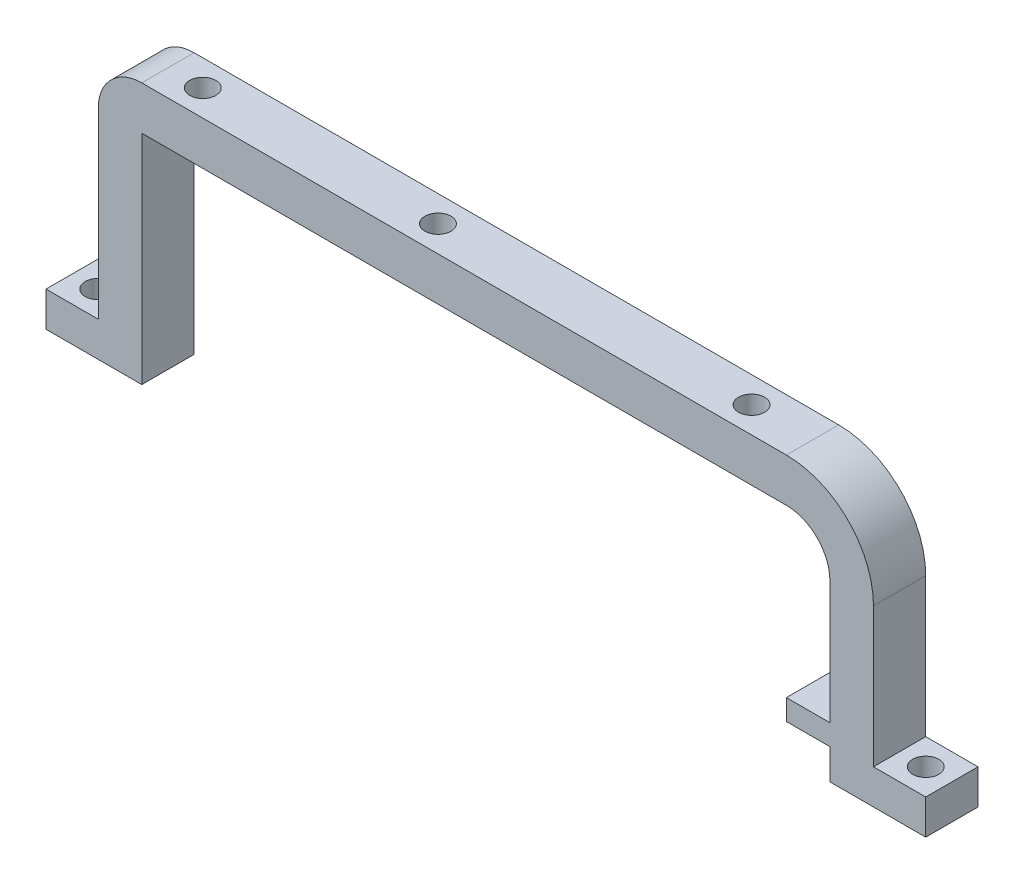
from build123d import *

# Parameters (mm, degrees)
RESSALTO_EXTRUS_O1_DEPTH = 6
ESBO_O4_R                = 1.5
CORTE_EXTRUS_O1_DEPTH    = 6
ESBO_O5_R                = 1.5
CORTE_EXTRUS_O2_DEPTH    = 6
ESBO_O11_R               = 1.5
CORTE_EXTRUS_O6_DEPTH    = 61.163221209
ESBO_O12_R               = 1.5
CORTE_EXTRUS_O7_DEPTH    = 61.163221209
ESBO_O14_R               = 1.5
CORTE_EXTRUS_O8_DEPTH    = 61.163221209


with BuildPart() as part:
    # Esbo_o2 → Ressalto-extrus_o1 (new body)
    with BuildSketch(Plane.XY):
        with BuildLine():
            Line((40.803602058, 0), (40.803602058, 14.116638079))
            ThreePointArc((40.803602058, 14.116638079), (39.339135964, 17.652171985), (35.803602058, 19.116638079))
            Line((35.803602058, 19.116638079), (-38.196397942, 19.116638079))
            Line((-38.196397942, 19.116638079), (-38.196397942, -5.883361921))
            Line((-38.196397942, -5.883361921), (-43.196397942, -5.883361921))
            Line((-43.196397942, -5.883361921), (-49.196397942, -5.883361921))
            Line((-49.196397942, -5.883361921), (-49.196397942, -1.883361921))
            Line((-49.196397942, -1.883361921), (-43.196397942, -1.883361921))
            Line((-43.196397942, -1.883361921), (-43.196397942, 19.116638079))
            ThreePointArc((-43.196397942, 19.116638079), (-41.731931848, 22.652171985), (-38.196397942, 24.116638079))
            Line((-38.196397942, 24.116638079), (35.803602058, 24.116638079))
            ThreePointArc((35.803602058, 24.116638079), (42.87466987, 21.187705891), (45.803602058, 14.116638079))
            Line((45.803602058, 14.116638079), (45.803602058, -1.883361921))
            Line((45.803602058, -1.883361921), (51.803602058, -1.883361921))
            Line((51.803602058, -1.883361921), (51.803602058, -5.883361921))
            Line((51.803602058, -5.883361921), (45.803602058, -5.883361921))
            Line((45.803602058, -5.883361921), (40.803602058, -5.883361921))
            Line((40.803602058, -5.883361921), (40.803602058, -2.383361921))
            Line((40.803602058, -2.383361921), (35.803602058, -2.383361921))
            Line((35.803602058, -2.383361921), (35.803602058, 0))
            Line((35.803602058, 0), (40.803602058, 0))
        make_face()
    extrude(amount=RESSALTO_EXTRUS_O1_DEPTH)

    # Esbo_o4 → Corte-extrus_o1 (cut)
    with BuildSketch(Plane(origin=(0, -1.883361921, 0), x_dir=(1, 0, 0), z_dir=(0, 1, 0))):
        with Locations(Location((48.803602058, -3, 0), (0, 0, 270))):
            Circle(ESBO_O4_R)
    extrude(amount=-CORTE_EXTRUS_O1_DEPTH, mode=Mode.SUBTRACT)

    # Esbo_o5 → Corte-extrus_o2 (cut)
    with BuildSketch(Plane(origin=(0, -1.883361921, 0), x_dir=(1, 0, 0), z_dir=(0, 1, 0))):
        with Locations(Location((-46.196397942, -3, 0), (0, 0, 270))):
            Circle(ESBO_O5_R)
    extrude(amount=-CORTE_EXTRUS_O2_DEPTH, mode=Mode.SUBTRACT)

    # Esbo_o11 → Corte-extrus_o6 (cut, through all)
    with BuildSketch(Plane(origin=(0, 24.116638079, 0), x_dir=(1, 0, 0), z_dir=(0, 1, 0))):
        with Locations(Location((28.803602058, -3, 0), (0, 0, 270))):
            Circle(ESBO_O11_R)
    extrude(amount=-CORTE_EXTRUS_O6_DEPTH, mode=Mode.SUBTRACT)

    # Esbo_o12 → Corte-extrus_o7 (cut, through all)
    with BuildSketch(Plane(origin=(0, 24.116638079, 0), x_dir=(1, 0, 0), z_dir=(0, 1, 0))):
        with Locations(Location((-34.196397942, -3, 0), (0, 0, 270))):
            Circle(ESBO_O12_R)
    extrude(amount=-CORTE_EXTRUS_O7_DEPTH, mode=Mode.SUBTRACT)

    # Esbo_o14 → Corte-extrus_o8 (cut, through all)
    with BuildSketch(Plane(origin=(0, 24.116638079, 0), x_dir=(1, 0, 0), z_dir=(0, 1, 0))):
        with Locations(Location((-7.196397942, -3, 0), (0, 0, 270))):
            Circle(ESBO_O14_R)
    extrude(amount=-CORTE_EXTRUS_O8_DEPTH, mode=Mode.SUBTRACT)


solid = part.part
